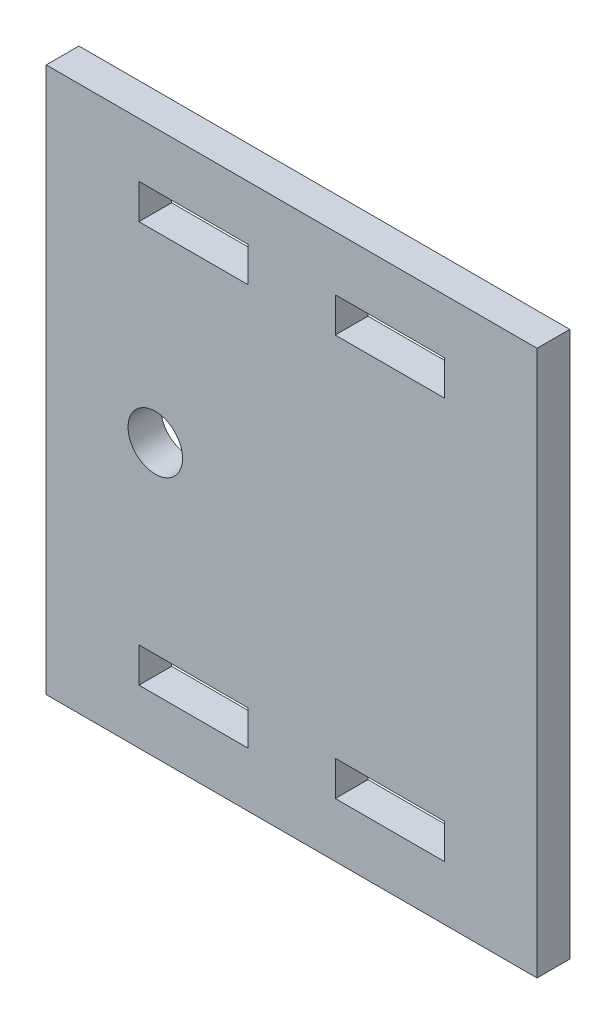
ISO-10303-21;
HEADER;
FILE_DESCRIPTION(('STEP AP214'),'2;1');
FILE_NAME('part.step','',(''),(''),'','','');
FILE_SCHEMA(('AUTOMOTIVE_DESIGN { 1 0 10303 214 1 1 1 1 }'));
ENDSEC;
DATA;
#1=APPLICATION_CONTEXT('core data for automotive mechanical design processes');
#2=APPLICATION_PROTOCOL_DEFINITION('international standard','automotive_design',2000,#1);
#3=PRODUCT_CONTEXT('',#1,'mechanical');
#4=PRODUCT('Part','Part','',(#3));
#5=PRODUCT_RELATED_PRODUCT_CATEGORY('part','',(#4));
#6=PRODUCT_DEFINITION_FORMATION('','',#4);
#7=PRODUCT_DEFINITION_CONTEXT('part definition',#1,'design');
#8=PRODUCT_DEFINITION('design','',#6,#7);
#9=PRODUCT_DEFINITION_SHAPE('','',#8);
#10=(LENGTH_UNIT() NAMED_UNIT(*) SI_UNIT(.MILLI.,.METRE.));
#11=(NAMED_UNIT(*) PLANE_ANGLE_UNIT() SI_UNIT($,.RADIAN.));
#12=(NAMED_UNIT(*) SI_UNIT($,.STERADIAN.) SOLID_ANGLE_UNIT());
#13=UNCERTAINTY_MEASURE_WITH_UNIT(LENGTH_MEASURE(1.E-05),#10,'distance_accuracy_value','');
#14=(GEOMETRIC_REPRESENTATION_CONTEXT(3) GLOBAL_UNCERTAINTY_ASSIGNED_CONTEXT((#13)) GLOBAL_UNIT_ASSIGNED_CONTEXT((#10,
#11,#12)) REPRESENTATION_CONTEXT('',''));
#15=CARTESIAN_POINT('',(0.,0.,0.));
#16=DIRECTION('',(0.,0.,1.));
#17=DIRECTION('',(1.,0.,0.));
#18=AXIS2_PLACEMENT_3D('',#15,#16,#17);
#19=CARTESIAN_POINT('',(0.,0.,3.));
#20=DIRECTION('',(0.,0.,1.));
#21=DIRECTION('',(1.,0.,0.));
#22=AXIS2_PLACEMENT_3D('',#19,#20,#21);
#23=PLANE('',#22);
#24=DIRECTION('',(0.,-1.,0.));
#25=VECTOR('',#24,1.);
#26=CARTESIAN_POINT('',(-10.,25.,3.));
#27=LINE('',#26,#25);
#28=CARTESIAN_POINT('',(-10.,25.,3.));
#29=VERTEX_POINT('',#28);
#30=CARTESIAN_POINT('',(-10.,-25.,3.));
#31=VERTEX_POINT('',#30);
#32=EDGE_CURVE('E305',#29,#31,#27,.T.);
#33=ORIENTED_EDGE('',*,*,#32,.T.);
#34=DIRECTION('',(1.,0.,0.));
#35=VECTOR('',#34,1.);
#36=CARTESIAN_POINT('',(-10.,-25.,3.));
#37=LINE('',#36,#35);
#38=CARTESIAN_POINT('',(35.,-25.,3.));
#39=VERTEX_POINT('',#38);
#40=EDGE_CURVE('E308',#31,#39,#37,.T.);
#41=ORIENTED_EDGE('',*,*,#40,.T.);
#42=DIRECTION('',(0.,1.,0.));
#43=VECTOR('',#42,1.);
#44=CARTESIAN_POINT('',(35.,25.,3.));
#45=LINE('',#44,#43);
#46=CARTESIAN_POINT('',(35.,25.,3.));
#47=VERTEX_POINT('',#46);
#48=EDGE_CURVE('E311',#39,#47,#45,.T.);
#49=ORIENTED_EDGE('',*,*,#48,.T.);
#50=DIRECTION('',(-1.,0.,0.));
#51=VECTOR('',#50,1.);
#52=CARTESIAN_POINT('',(-10.,25.,3.));
#53=LINE('',#52,#51);
#54=EDGE_CURVE('E313',#47,#29,#53,.T.);
#55=ORIENTED_EDGE('',*,*,#54,.T.);
#56=EDGE_LOOP('',(#33,#41,#49,#55));
#57=FACE_BOUND('',#56,.T.);
#58=CARTESIAN_POINT('',(0.,0.,3.));
#59=DIRECTION('',(0.,0.,1.));
#60=DIRECTION('',(1.,0.,0.));
#61=AXIS2_PLACEMENT_3D('',#58,#59,#60);
#62=CIRCLE('',#61,2.5);
#63=CARTESIAN_POINT('',(2.5,0.,3.));
#64=VERTEX_POINT('',#63);
#65=EDGE_CURVE('E299',#64,#64,#62,.T.);
#66=ORIENTED_EDGE('',*,*,#65,.F.);
#67=EDGE_LOOP('',(#66));
#68=FACE_BOUND('',#67,.T.);
#69=DIRECTION('',(1.,0.,0.));
#70=VECTOR('',#69,1.);
#71=CARTESIAN_POINT('',(-1.5,16.8,3.));
#72=LINE('',#71,#70);
#73=CARTESIAN_POINT('',(-1.5,16.8,3.));
#74=VERTEX_POINT('',#73);
#75=CARTESIAN_POINT('',(8.5,16.8,3.));
#76=VERTEX_POINT('',#75);
#77=EDGE_CURVE('E270',#74,#76,#72,.T.);
#78=ORIENTED_EDGE('',*,*,#77,.F.);
#79=DIRECTION('',(0.,-1.,0.));
#80=VECTOR('',#79,1.);
#81=CARTESIAN_POINT('',(-1.5,20.,3.));
#82=LINE('',#81,#80);
#83=CARTESIAN_POINT('',(-1.5,20.,3.));
#84=VERTEX_POINT('',#83);
#85=EDGE_CURVE('E268',#84,#74,#82,.T.);
#86=ORIENTED_EDGE('',*,*,#85,.F.);
#87=DIRECTION('',(-1.,0.,0.));
#88=VECTOR('',#87,1.);
#89=CARTESIAN_POINT('',(-1.5,20.,3.));
#90=LINE('',#89,#88);
#91=CARTESIAN_POINT('',(8.5,20.,3.));
#92=VERTEX_POINT('',#91);
#93=EDGE_CURVE('E276',#92,#84,#90,.T.);
#94=ORIENTED_EDGE('',*,*,#93,.F.);
#95=DIRECTION('',(0.,1.,0.));
#96=VECTOR('',#95,1.);
#97=CARTESIAN_POINT('',(8.5,20.,3.));
#98=LINE('',#97,#96);
#99=EDGE_CURVE('E273',#76,#92,#98,.T.);
#100=ORIENTED_EDGE('',*,*,#99,.F.);
#101=EDGE_LOOP('',(#78,#86,#94,#100));
#102=FACE_BOUND('',#101,.T.);
#103=DIRECTION('',(1.,0.,0.));
#104=VECTOR('',#103,1.);
#105=CARTESIAN_POINT('',(16.5,16.8,3.));
#106=LINE('',#105,#104);
#107=CARTESIAN_POINT('',(16.5,16.8,3.));
#108=VERTEX_POINT('',#107);
#109=CARTESIAN_POINT('',(26.5,16.8,3.));
#110=VERTEX_POINT('',#109);
#111=EDGE_CURVE('E239',#108,#110,#106,.T.);
#112=ORIENTED_EDGE('',*,*,#111,.F.);
#113=DIRECTION('',(0.,-1.,0.));
#114=VECTOR('',#113,1.);
#115=CARTESIAN_POINT('',(16.5,20.,3.));
#116=LINE('',#115,#114);
#117=CARTESIAN_POINT('',(16.5,20.,3.));
#118=VERTEX_POINT('',#117);
#119=EDGE_CURVE('E237',#118,#108,#116,.T.);
#120=ORIENTED_EDGE('',*,*,#119,.F.);
#121=DIRECTION('',(-1.,0.,0.));
#122=VECTOR('',#121,1.);
#123=CARTESIAN_POINT('',(16.5,20.,3.));
#124=LINE('',#123,#122);
#125=CARTESIAN_POINT('',(26.5,20.,3.));
#126=VERTEX_POINT('',#125);
#127=EDGE_CURVE('E245',#126,#118,#124,.T.);
#128=ORIENTED_EDGE('',*,*,#127,.F.);
#129=DIRECTION('',(0.,1.,0.));
#130=VECTOR('',#129,1.);
#131=CARTESIAN_POINT('',(26.5,20.,3.));
#132=LINE('',#131,#130);
#133=EDGE_CURVE('E242',#110,#126,#132,.T.);
#134=ORIENTED_EDGE('',*,*,#133,.F.);
#135=EDGE_LOOP('',(#112,#120,#128,#134));
#136=FACE_BOUND('',#135,.T.);
#137=DIRECTION('',(1.,0.,0.));
#138=VECTOR('',#137,1.);
#139=CARTESIAN_POINT('',(16.5,-20.,3.));
#140=LINE('',#139,#138);
#141=CARTESIAN_POINT('',(16.5,-20.,3.));
#142=VERTEX_POINT('',#141);
#143=CARTESIAN_POINT('',(26.5,-20.,3.));
#144=VERTEX_POINT('',#143);
#145=EDGE_CURVE('E208',#142,#144,#140,.T.);
#146=ORIENTED_EDGE('',*,*,#145,.F.);
#147=DIRECTION('',(0.,-1.,0.));
#148=VECTOR('',#147,1.);
#149=CARTESIAN_POINT('',(16.5,-20.,3.));
#150=LINE('',#149,#148);
#151=CARTESIAN_POINT('',(16.5,-16.8,3.));
#152=VERTEX_POINT('',#151);
#153=EDGE_CURVE('E206',#152,#142,#150,.T.);
#154=ORIENTED_EDGE('',*,*,#153,.F.);
#155=DIRECTION('',(-1.,0.,0.));
#156=VECTOR('',#155,1.);
#157=CARTESIAN_POINT('',(16.5,-16.8,3.));
#158=LINE('',#157,#156);
#159=CARTESIAN_POINT('',(26.5,-16.8,3.));
#160=VERTEX_POINT('',#159);
#161=EDGE_CURVE('E214',#160,#152,#158,.T.);
#162=ORIENTED_EDGE('',*,*,#161,.F.);
#163=DIRECTION('',(0.,1.,0.));
#164=VECTOR('',#163,1.);
#165=CARTESIAN_POINT('',(26.5,-20.,3.));
#166=LINE('',#165,#164);
#167=EDGE_CURVE('E211',#144,#160,#166,.T.);
#168=ORIENTED_EDGE('',*,*,#167,.F.);
#169=EDGE_LOOP('',(#146,#154,#162,#168));
#170=FACE_BOUND('',#169,.T.);
#171=DIRECTION('',(0.,1.,0.));
#172=VECTOR('',#171,1.);
#173=CARTESIAN_POINT('',(8.5,-20.,3.));
#174=LINE('',#173,#172);
#175=CARTESIAN_POINT('',(8.5,-20.,3.));
#176=VERTEX_POINT('',#175);
#177=CARTESIAN_POINT('',(8.5,-16.8,3.));
#178=VERTEX_POINT('',#177);
#179=EDGE_CURVE('E178',#176,#178,#174,.T.);
#180=ORIENTED_EDGE('',*,*,#179,.F.);
#181=DIRECTION('',(1.,0.,0.));
#182=VECTOR('',#181,1.);
#183=CARTESIAN_POINT('',(-1.5,-20.,3.));
#184=LINE('',#183,#182);
#185=CARTESIAN_POINT('',(-1.5,-20.,3.));
#186=VERTEX_POINT('',#185);
#187=EDGE_CURVE('E170',#186,#176,#184,.T.);
#188=ORIENTED_EDGE('',*,*,#187,.F.);
#189=DIRECTION('',(0.,-1.,0.));
#190=VECTOR('',#189,1.);
#191=CARTESIAN_POINT('',(-1.5,-20.,3.));
#192=LINE('',#191,#190);
#193=CARTESIAN_POINT('',(-1.5,-16.8,3.));
#194=VERTEX_POINT('',#193);
#195=EDGE_CURVE('E192',#194,#186,#192,.T.);
#196=ORIENTED_EDGE('',*,*,#195,.F.);
#197=DIRECTION('',(-1.,0.,0.));
#198=VECTOR('',#197,1.);
#199=CARTESIAN_POINT('',(-1.5,-16.8,3.));
#200=LINE('',#199,#198);
#201=EDGE_CURVE('E190',#178,#194,#200,.T.);
#202=ORIENTED_EDGE('',*,*,#201,.F.);
#203=EDGE_LOOP('',(#180,#188,#196,#202));
#204=FACE_BOUND('',#203,.T.);
#205=ADVANCED_FACE('F33',(#57,#68,#102,#136,#170,#204),#23,.T.);
#206=CARTESIAN_POINT('',(0.,0.,0.));
#207=DIRECTION('',(0.,0.,1.));
#208=DIRECTION('',(1.,0.,0.));
#209=AXIS2_PLACEMENT_3D('',#206,#207,#208);
#210=PLANE('',#209);
#211=DIRECTION('',(0.,-1.,0.));
#212=VECTOR('',#211,1.);
#213=CARTESIAN_POINT('',(16.5,-20.,0.));
#214=LINE('',#213,#212);
#215=CARTESIAN_POINT('',(16.5,-16.8,0.));
#216=VERTEX_POINT('',#215);
#217=CARTESIAN_POINT('',(16.5,-20.,0.));
#218=VERTEX_POINT('',#217);
#219=EDGE_CURVE('E186',#216,#218,#214,.T.);
#220=ORIENTED_EDGE('',*,*,#219,.T.);
#221=DIRECTION('',(1.,0.,0.));
#222=VECTOR('',#221,1.);
#223=CARTESIAN_POINT('',(16.5,-20.,0.));
#224=LINE('',#223,#222);
#225=CARTESIAN_POINT('',(26.5,-20.,0.));
#226=VERTEX_POINT('',#225);
#227=EDGE_CURVE('E219',#218,#226,#224,.T.);
#228=ORIENTED_EDGE('',*,*,#227,.T.);
#229=DIRECTION('',(0.,1.,0.));
#230=VECTOR('',#229,1.);
#231=CARTESIAN_POINT('',(26.5,-20.,0.));
#232=LINE('',#231,#230);
#233=CARTESIAN_POINT('',(26.5,-16.8,0.));
#234=VERTEX_POINT('',#233);
#235=EDGE_CURVE('E222',#226,#234,#232,.T.);
#236=ORIENTED_EDGE('',*,*,#235,.T.);
#237=DIRECTION('',(-1.,0.,0.));
#238=VECTOR('',#237,1.);
#239=CARTESIAN_POINT('',(16.5,-16.8,0.));
#240=LINE('',#239,#238);
#241=EDGE_CURVE('E209',#234,#216,#240,.T.);
#242=ORIENTED_EDGE('',*,*,#241,.T.);
#243=EDGE_LOOP('',(#220,#228,#236,#242));
#244=FACE_BOUND('',#243,.T.);
#245=DIRECTION('',(0.,-1.,0.));
#246=VECTOR('',#245,1.);
#247=CARTESIAN_POINT('',(-1.5,20.,0.));
#248=LINE('',#247,#246);
#249=CARTESIAN_POINT('',(-1.5,20.,0.));
#250=VERTEX_POINT('',#249);
#251=CARTESIAN_POINT('',(-1.5,16.8,0.));
#252=VERTEX_POINT('',#251);
#253=EDGE_CURVE('E267',#250,#252,#248,.T.);
#254=ORIENTED_EDGE('',*,*,#253,.T.);
#255=DIRECTION('',(1.,0.,0.));
#256=VECTOR('',#255,1.);
#257=CARTESIAN_POINT('',(-1.5,16.8,0.));
#258=LINE('',#257,#256);
#259=CARTESIAN_POINT('',(8.5,16.8,0.));
#260=VERTEX_POINT('',#259);
#261=EDGE_CURVE('E281',#252,#260,#258,.T.);
#262=ORIENTED_EDGE('',*,*,#261,.T.);
#263=DIRECTION('',(0.,1.,0.));
#264=VECTOR('',#263,1.);
#265=CARTESIAN_POINT('',(8.5,20.,0.));
#266=LINE('',#265,#264);
#267=CARTESIAN_POINT('',(8.5,20.,0.));
#268=VERTEX_POINT('',#267);
#269=EDGE_CURVE('E284',#260,#268,#266,.T.);
#270=ORIENTED_EDGE('',*,*,#269,.T.);
#271=DIRECTION('',(-1.,0.,0.));
#272=VECTOR('',#271,1.);
#273=CARTESIAN_POINT('',(-1.5,20.,0.));
#274=LINE('',#273,#272);
#275=EDGE_CURVE('E271',#268,#250,#274,.T.);
#276=ORIENTED_EDGE('',*,*,#275,.T.);
#277=EDGE_LOOP('',(#254,#262,#270,#276));
#278=FACE_BOUND('',#277,.T.);
#279=DIRECTION('',(0.,-1.,0.));
#280=VECTOR('',#279,1.);
#281=CARTESIAN_POINT('',(-10.,25.,0.));
#282=LINE('',#281,#280);
#283=CARTESIAN_POINT('',(-10.,25.,0.));
#284=VERTEX_POINT('',#283);
#285=CARTESIAN_POINT('',(-10.,-25.,0.));
#286=VERTEX_POINT('',#285);
#287=EDGE_CURVE('E302',#284,#286,#282,.T.);
#288=ORIENTED_EDGE('',*,*,#287,.F.);
#289=DIRECTION('',(-1.,0.,0.));
#290=VECTOR('',#289,1.);
#291=CARTESIAN_POINT('',(-10.,25.,0.));
#292=LINE('',#291,#290);
#293=CARTESIAN_POINT('',(35.,25.,0.));
#294=VERTEX_POINT('',#293);
#295=EDGE_CURVE('E309',#294,#284,#292,.T.);
#296=ORIENTED_EDGE('',*,*,#295,.F.);
#297=DIRECTION('',(0.,1.,0.));
#298=VECTOR('',#297,1.);
#299=CARTESIAN_POINT('',(35.,25.,0.));
#300=LINE('',#299,#298);
#301=CARTESIAN_POINT('',(35.,-25.,0.));
#302=VERTEX_POINT('',#301);
#303=EDGE_CURVE('E320',#302,#294,#300,.T.);
#304=ORIENTED_EDGE('',*,*,#303,.F.);
#305=DIRECTION('',(1.,0.,0.));
#306=VECTOR('',#305,1.);
#307=CARTESIAN_POINT('',(-10.,-25.,0.));
#308=LINE('',#307,#306);
#309=EDGE_CURVE('E318',#286,#302,#308,.T.);
#310=ORIENTED_EDGE('',*,*,#309,.F.);
#311=EDGE_LOOP('',(#288,#296,#304,#310));
#312=FACE_BOUND('',#311,.T.);
#313=CARTESIAN_POINT('',(0.,0.,0.));
#314=DIRECTION('',(0.,0.,1.));
#315=DIRECTION('',(1.,0.,0.));
#316=AXIS2_PLACEMENT_3D('',#313,#314,#315);
#317=CIRCLE('',#316,2.5);
#318=CARTESIAN_POINT('',(2.5,0.,0.));
#319=VERTEX_POINT('',#318);
#320=EDGE_CURVE('E298',#319,#319,#317,.T.);
#321=ORIENTED_EDGE('',*,*,#320,.T.);
#322=EDGE_LOOP('',(#321));
#323=FACE_BOUND('',#322,.T.);
#324=DIRECTION('',(0.,-1.,0.));
#325=VECTOR('',#324,1.);
#326=CARTESIAN_POINT('',(16.5,20.,0.));
#327=LINE('',#326,#325);
#328=CARTESIAN_POINT('',(16.5,20.,0.));
#329=VERTEX_POINT('',#328);
#330=CARTESIAN_POINT('',(16.5,16.8,0.));
#331=VERTEX_POINT('',#330);
#332=EDGE_CURVE('E236',#329,#331,#327,.T.);
#333=ORIENTED_EDGE('',*,*,#332,.T.);
#334=DIRECTION('',(1.,0.,0.));
#335=VECTOR('',#334,1.);
#336=CARTESIAN_POINT('',(16.5,16.8,0.));
#337=LINE('',#336,#335);
#338=CARTESIAN_POINT('',(26.5,16.8,0.));
#339=VERTEX_POINT('',#338);
#340=EDGE_CURVE('E250',#331,#339,#337,.T.);
#341=ORIENTED_EDGE('',*,*,#340,.T.);
#342=DIRECTION('',(0.,1.,0.));
#343=VECTOR('',#342,1.);
#344=CARTESIAN_POINT('',(26.5,20.,0.));
#345=LINE('',#344,#343);
#346=CARTESIAN_POINT('',(26.5,20.,0.));
#347=VERTEX_POINT('',#346);
#348=EDGE_CURVE('E253',#339,#347,#345,.T.);
#349=ORIENTED_EDGE('',*,*,#348,.T.);
#350=DIRECTION('',(-1.,0.,0.));
#351=VECTOR('',#350,1.);
#352=CARTESIAN_POINT('',(16.5,20.,0.));
#353=LINE('',#352,#351);
#354=EDGE_CURVE('E240',#347,#329,#353,.T.);
#355=ORIENTED_EDGE('',*,*,#354,.T.);
#356=EDGE_LOOP('',(#333,#341,#349,#355));
#357=FACE_BOUND('',#356,.T.);
#358=DIRECTION('',(1.,0.,0.));
#359=VECTOR('',#358,1.);
#360=CARTESIAN_POINT('',(-1.5,-20.,0.));
#361=LINE('',#360,#359);
#362=CARTESIAN_POINT('',(-1.5,-20.,0.));
#363=VERTEX_POINT('',#362);
#364=CARTESIAN_POINT('',(8.5,-20.,0.));
#365=VERTEX_POINT('',#364);
#366=EDGE_CURVE('E56',#363,#365,#361,.T.);
#367=ORIENTED_EDGE('',*,*,#366,.T.);
#368=DIRECTION('',(0.,1.,0.));
#369=VECTOR('',#368,1.);
#370=CARTESIAN_POINT('',(8.5,-20.,0.));
#371=LINE('',#370,#369);
#372=CARTESIAN_POINT('',(8.5,-16.8,0.));
#373=VERTEX_POINT('',#372);
#374=EDGE_CURVE('E185',#365,#373,#371,.T.);
#375=ORIENTED_EDGE('',*,*,#374,.T.);
#376=DIRECTION('',(-1.,0.,0.));
#377=VECTOR('',#376,1.);
#378=CARTESIAN_POINT('',(-1.5,-16.8,0.));
#379=LINE('',#378,#377);
#380=CARTESIAN_POINT('',(-1.5,-16.8,0.));
#381=VERTEX_POINT('',#380);
#382=EDGE_CURVE('E198',#373,#381,#379,.T.);
#383=ORIENTED_EDGE('',*,*,#382,.T.);
#384=DIRECTION('',(0.,-1.,0.));
#385=VECTOR('',#384,1.);
#386=CARTESIAN_POINT('',(-1.5,-20.,0.));
#387=LINE('',#386,#385);
#388=EDGE_CURVE('E179',#381,#363,#387,.T.);
#389=ORIENTED_EDGE('',*,*,#388,.T.);
#390=EDGE_LOOP('',(#367,#375,#383,#389));
#391=FACE_BOUND('',#390,.T.);
#392=ADVANCED_FACE('F338',(#244,#278,#312,#323,#357,#391),#210,.F.);
#393=CARTESIAN_POINT('',(-10.,25.,3.));
#394=DIRECTION('',(1.,0.,0.));
#395=DIRECTION('',(0.,1.,0.));
#396=AXIS2_PLACEMENT_3D('',#393,#394,#395);
#397=PLANE('',#396);
#398=ORIENTED_EDGE('',*,*,#287,.T.);
#399=DIRECTION('',(0.,0.,-1.));
#400=VECTOR('',#399,1.);
#401=CARTESIAN_POINT('',(-10.,-25.,3.));
#402=LINE('',#401,#400);
#403=EDGE_CURVE('E11',#31,#286,#402,.T.);
#404=ORIENTED_EDGE('',*,*,#403,.F.);
#405=ORIENTED_EDGE('',*,*,#32,.F.);
#406=DIRECTION('',(0.,0.,-1.));
#407=VECTOR('',#406,1.);
#408=CARTESIAN_POINT('',(-10.,25.,3.));
#409=LINE('',#408,#407);
#410=EDGE_CURVE('E315',#29,#284,#409,.T.);
#411=ORIENTED_EDGE('',*,*,#410,.T.);
#412=EDGE_LOOP('',(#398,#404,#405,#411));
#413=FACE_BOUND('',#412,.T.);
#414=ADVANCED_FACE('F35',(#413),#397,.F.);
#415=CARTESIAN_POINT('',(-10.,-25.,3.));
#416=DIRECTION('',(0.,1.,0.));
#417=DIRECTION('',(0.,0.,1.));
#418=AXIS2_PLACEMENT_3D('',#415,#416,#417);
#419=PLANE('',#418);
#420=ORIENTED_EDGE('',*,*,#309,.T.);
#421=DIRECTION('',(0.,0.,-1.));
#422=VECTOR('',#421,1.);
#423=CARTESIAN_POINT('',(35.,-25.,3.));
#424=LINE('',#423,#422);
#425=EDGE_CURVE('E41',#39,#302,#424,.T.);
#426=ORIENTED_EDGE('',*,*,#425,.F.);
#427=ORIENTED_EDGE('',*,*,#40,.F.);
#428=ORIENTED_EDGE('',*,*,#403,.T.);
#429=EDGE_LOOP('',(#420,#426,#427,#428));
#430=FACE_BOUND('',#429,.T.);
#431=ADVANCED_FACE('F349',(#430),#419,.F.);
#432=CARTESIAN_POINT('',(35.,25.,3.));
#433=DIRECTION('',(-1.,0.,0.));
#434=DIRECTION('',(0.,-1.,0.));
#435=AXIS2_PLACEMENT_3D('',#432,#433,#434);
#436=PLANE('',#435);
#437=ORIENTED_EDGE('',*,*,#303,.T.);
#438=DIRECTION('',(0.,0.,-1.));
#439=VECTOR('',#438,1.);
#440=CARTESIAN_POINT('',(35.,25.,3.));
#441=LINE('',#440,#439);
#442=EDGE_CURVE('E325',#47,#294,#441,.T.);
#443=ORIENTED_EDGE('',*,*,#442,.F.);
#444=ORIENTED_EDGE('',*,*,#48,.F.);
#445=ORIENTED_EDGE('',*,*,#425,.T.);
#446=EDGE_LOOP('',(#437,#443,#444,#445));
#447=FACE_BOUND('',#446,.T.);
#448=ADVANCED_FACE('F332',(#447),#436,.F.);
#449=CARTESIAN_POINT('',(-10.,25.,3.));
#450=DIRECTION('',(0.,-1.,0.));
#451=DIRECTION('',(1.,0.,0.));
#452=AXIS2_PLACEMENT_3D('',#449,#450,#451);
#453=PLANE('',#452);
#454=ORIENTED_EDGE('',*,*,#295,.T.);
#455=ORIENTED_EDGE('',*,*,#410,.F.);
#456=ORIENTED_EDGE('',*,*,#54,.F.);
#457=ORIENTED_EDGE('',*,*,#442,.T.);
#458=EDGE_LOOP('',(#454,#455,#456,#457));
#459=FACE_BOUND('',#458,.T.);
#460=ADVANCED_FACE('F342',(#459),#453,.F.);
#461=CARTESIAN_POINT('',(0.,0.,3.));
#462=DIRECTION('',(0.,0.,-1.));
#463=DIRECTION('',(-1.,0.,0.));
#464=AXIS2_PLACEMENT_3D('',#461,#462,#463);
#465=CYLINDRICAL_SURFACE('',#464,2.5);
#466=ORIENTED_EDGE('',*,*,#65,.T.);
#467=EDGE_LOOP('',(#466));
#468=FACE_BOUND('',#467,.T.);
#469=ORIENTED_EDGE('',*,*,#320,.F.);
#470=EDGE_LOOP('',(#469));
#471=FACE_BOUND('',#470,.T.);
#472=ADVANCED_FACE('F364',(#468,#471),#465,.F.);
#473=CARTESIAN_POINT('',(-1.5,20.,3.));
#474=DIRECTION('',(1.,0.,0.));
#475=DIRECTION('',(0.,0.,-1.));
#476=AXIS2_PLACEMENT_3D('',#473,#474,#475);
#477=PLANE('',#476);
#478=ORIENTED_EDGE('',*,*,#253,.F.);
#479=DIRECTION('',(0.,0.,-1.));
#480=VECTOR('',#479,1.);
#481=CARTESIAN_POINT('',(-1.5,20.,3.));
#482=LINE('',#481,#480);
#483=EDGE_CURVE('E278',#84,#250,#482,.T.);
#484=ORIENTED_EDGE('',*,*,#483,.F.);
#485=ORIENTED_EDGE('',*,*,#85,.T.);
#486=DIRECTION('',(0.,0.,-1.));
#487=VECTOR('',#486,1.);
#488=CARTESIAN_POINT('',(-1.5,16.8,3.));
#489=LINE('',#488,#487);
#490=EDGE_CURVE('E295',#74,#252,#489,.T.);
#491=ORIENTED_EDGE('',*,*,#490,.T.);
#492=EDGE_LOOP('',(#478,#484,#485,#491));
#493=FACE_BOUND('',#492,.T.);
#494=ADVANCED_FACE('F371',(#493),#477,.T.);
#495=CARTESIAN_POINT('',(-1.5,16.8,3.));
#496=DIRECTION('',(0.,1.,0.));
#497=DIRECTION('',(0.,0.,1.));
#498=AXIS2_PLACEMENT_3D('',#495,#496,#497);
#499=PLANE('',#498);
#500=ORIENTED_EDGE('',*,*,#261,.F.);
#501=ORIENTED_EDGE('',*,*,#490,.F.);
#502=ORIENTED_EDGE('',*,*,#77,.T.);
#503=DIRECTION('',(0.,0.,-1.));
#504=VECTOR('',#503,1.);
#505=CARTESIAN_POINT('',(8.5,16.8,3.));
#506=LINE('',#505,#504);
#507=EDGE_CURVE('E293',#76,#260,#506,.T.);
#508=ORIENTED_EDGE('',*,*,#507,.T.);
#509=EDGE_LOOP('',(#500,#501,#502,#508));
#510=FACE_BOUND('',#509,.T.);
#511=ADVANCED_FACE('F376',(#510),#499,.T.);
#512=CARTESIAN_POINT('',(8.5,20.,3.));
#513=DIRECTION('',(-1.,0.,0.));
#514=DIRECTION('',(0.,0.,1.));
#515=AXIS2_PLACEMENT_3D('',#512,#513,#514);
#516=PLANE('',#515);
#517=ORIENTED_EDGE('',*,*,#269,.F.);
#518=ORIENTED_EDGE('',*,*,#507,.F.);
#519=ORIENTED_EDGE('',*,*,#99,.T.);
#520=DIRECTION('',(0.,0.,-1.));
#521=VECTOR('',#520,1.);
#522=CARTESIAN_POINT('',(8.5,20.,3.));
#523=LINE('',#522,#521);
#524=EDGE_CURVE('E291',#92,#268,#523,.T.);
#525=ORIENTED_EDGE('',*,*,#524,.T.);
#526=EDGE_LOOP('',(#517,#518,#519,#525));
#527=FACE_BOUND('',#526,.T.);
#528=ADVANCED_FACE('F433',(#527),#516,.T.);
#529=CARTESIAN_POINT('',(-1.5,20.,3.));
#530=DIRECTION('',(0.,-1.,0.));
#531=DIRECTION('',(0.,0.,-1.));
#532=AXIS2_PLACEMENT_3D('',#529,#530,#531);
#533=PLANE('',#532);
#534=ORIENTED_EDGE('',*,*,#275,.F.);
#535=ORIENTED_EDGE('',*,*,#524,.F.);
#536=ORIENTED_EDGE('',*,*,#93,.T.);
#537=ORIENTED_EDGE('',*,*,#483,.T.);
#538=EDGE_LOOP('',(#534,#535,#536,#537));
#539=FACE_BOUND('',#538,.T.);
#540=ADVANCED_FACE('F429',(#539),#533,.T.);
#541=CARTESIAN_POINT('',(16.5,20.,3.));
#542=DIRECTION('',(1.,0.,0.));
#543=DIRECTION('',(0.,0.,-1.));
#544=AXIS2_PLACEMENT_3D('',#541,#542,#543);
#545=PLANE('',#544);
#546=ORIENTED_EDGE('',*,*,#332,.F.);
#547=DIRECTION('',(0.,0.,-1.));
#548=VECTOR('',#547,1.);
#549=CARTESIAN_POINT('',(16.5,20.,3.));
#550=LINE('',#549,#548);
#551=EDGE_CURVE('E247',#118,#329,#550,.T.);
#552=ORIENTED_EDGE('',*,*,#551,.F.);
#553=ORIENTED_EDGE('',*,*,#119,.T.);
#554=DIRECTION('',(0.,0.,-1.));
#555=VECTOR('',#554,1.);
#556=CARTESIAN_POINT('',(16.5,16.8,3.));
#557=LINE('',#556,#555);
#558=EDGE_CURVE('E264',#108,#331,#557,.T.);
#559=ORIENTED_EDGE('',*,*,#558,.T.);
#560=EDGE_LOOP('',(#546,#552,#553,#559));
#561=FACE_BOUND('',#560,.T.);
#562=ADVANCED_FACE('F425',(#561),#545,.T.);
#563=CARTESIAN_POINT('',(16.5,16.8,3.));
#564=DIRECTION('',(0.,1.,0.));
#565=DIRECTION('',(-1.,0.,0.));
#566=AXIS2_PLACEMENT_3D('',#563,#564,#565);
#567=PLANE('',#566);
#568=ORIENTED_EDGE('',*,*,#340,.F.);
#569=ORIENTED_EDGE('',*,*,#558,.F.);
#570=ORIENTED_EDGE('',*,*,#111,.T.);
#571=DIRECTION('',(0.,0.,-1.));
#572=VECTOR('',#571,1.);
#573=CARTESIAN_POINT('',(26.5,16.8,3.));
#574=LINE('',#573,#572);
#575=EDGE_CURVE('E262',#110,#339,#574,.T.);
#576=ORIENTED_EDGE('',*,*,#575,.T.);
#577=EDGE_LOOP('',(#568,#569,#570,#576));
#578=FACE_BOUND('',#577,.T.);
#579=ADVANCED_FACE('F421',(#578),#567,.T.);
#580=CARTESIAN_POINT('',(26.5,20.,3.));
#581=DIRECTION('',(-1.,0.,0.));
#582=DIRECTION('',(0.,0.,1.));
#583=AXIS2_PLACEMENT_3D('',#580,#581,#582);
#584=PLANE('',#583);
#585=ORIENTED_EDGE('',*,*,#348,.F.);
#586=ORIENTED_EDGE('',*,*,#575,.F.);
#587=ORIENTED_EDGE('',*,*,#133,.T.);
#588=DIRECTION('',(0.,0.,-1.));
#589=VECTOR('',#588,1.);
#590=CARTESIAN_POINT('',(26.5,20.,3.));
#591=LINE('',#590,#589);
#592=EDGE_CURVE('E260',#126,#347,#591,.T.);
#593=ORIENTED_EDGE('',*,*,#592,.T.);
#594=EDGE_LOOP('',(#585,#586,#587,#593));
#595=FACE_BOUND('',#594,.T.);
#596=ADVANCED_FACE('F417',(#595),#584,.T.);
#597=CARTESIAN_POINT('',(16.5,20.,3.));
#598=DIRECTION('',(0.,-1.,0.));
#599=DIRECTION('',(0.,0.,-1.));
#600=AXIS2_PLACEMENT_3D('',#597,#598,#599);
#601=PLANE('',#600);
#602=ORIENTED_EDGE('',*,*,#354,.F.);
#603=ORIENTED_EDGE('',*,*,#592,.F.);
#604=ORIENTED_EDGE('',*,*,#127,.T.);
#605=ORIENTED_EDGE('',*,*,#551,.T.);
#606=EDGE_LOOP('',(#602,#603,#604,#605));
#607=FACE_BOUND('',#606,.T.);
#608=ADVANCED_FACE('F413',(#607),#601,.T.);
#609=CARTESIAN_POINT('',(16.5,-20.,3.));
#610=DIRECTION('',(1.,0.,0.));
#611=DIRECTION('',(0.,0.,-1.));
#612=AXIS2_PLACEMENT_3D('',#609,#610,#611);
#613=PLANE('',#612);
#614=ORIENTED_EDGE('',*,*,#219,.F.);
#615=DIRECTION('',(0.,0.,-1.));
#616=VECTOR('',#615,1.);
#617=CARTESIAN_POINT('',(16.5,-16.8,3.));
#618=LINE('',#617,#616);
#619=EDGE_CURVE('E216',#152,#216,#618,.T.);
#620=ORIENTED_EDGE('',*,*,#619,.F.);
#621=ORIENTED_EDGE('',*,*,#153,.T.);
#622=DIRECTION('',(0.,0.,-1.));
#623=VECTOR('',#622,1.);
#624=CARTESIAN_POINT('',(16.5,-20.,3.));
#625=LINE('',#624,#623);
#626=EDGE_CURVE('E233',#142,#218,#625,.T.);
#627=ORIENTED_EDGE('',*,*,#626,.T.);
#628=EDGE_LOOP('',(#614,#620,#621,#627));
#629=FACE_BOUND('',#628,.T.);
#630=ADVANCED_FACE('F409',(#629),#613,.T.);
#631=CARTESIAN_POINT('',(16.5,-20.,3.));
#632=DIRECTION('',(0.,1.,0.));
#633=DIRECTION('',(0.,0.,1.));
#634=AXIS2_PLACEMENT_3D('',#631,#632,#633);
#635=PLANE('',#634);
#636=ORIENTED_EDGE('',*,*,#227,.F.);
#637=ORIENTED_EDGE('',*,*,#626,.F.);
#638=ORIENTED_EDGE('',*,*,#145,.T.);
#639=DIRECTION('',(0.,0.,-1.));
#640=VECTOR('',#639,1.);
#641=CARTESIAN_POINT('',(26.5,-20.,3.));
#642=LINE('',#641,#640);
#643=EDGE_CURVE('E231',#144,#226,#642,.T.);
#644=ORIENTED_EDGE('',*,*,#643,.T.);
#645=EDGE_LOOP('',(#636,#637,#638,#644));
#646=FACE_BOUND('',#645,.T.);
#647=ADVANCED_FACE('F405',(#646),#635,.T.);
#648=CARTESIAN_POINT('',(26.5,-20.,3.));
#649=DIRECTION('',(-1.,0.,0.));
#650=DIRECTION('',(0.,0.,1.));
#651=AXIS2_PLACEMENT_3D('',#648,#649,#650);
#652=PLANE('',#651);
#653=ORIENTED_EDGE('',*,*,#235,.F.);
#654=ORIENTED_EDGE('',*,*,#643,.F.);
#655=ORIENTED_EDGE('',*,*,#167,.T.);
#656=DIRECTION('',(0.,0.,-1.));
#657=VECTOR('',#656,1.);
#658=CARTESIAN_POINT('',(26.5,-16.8,3.));
#659=LINE('',#658,#657);
#660=EDGE_CURVE('E229',#160,#234,#659,.T.);
#661=ORIENTED_EDGE('',*,*,#660,.T.);
#662=EDGE_LOOP('',(#653,#654,#655,#661));
#663=FACE_BOUND('',#662,.T.);
#664=ADVANCED_FACE('F401',(#663),#652,.T.);
#665=CARTESIAN_POINT('',(16.5,-16.8,3.));
#666=DIRECTION('',(0.,-1.,0.));
#667=DIRECTION('',(1.,0.,0.));
#668=AXIS2_PLACEMENT_3D('',#665,#666,#667);
#669=PLANE('',#668);
#670=ORIENTED_EDGE('',*,*,#241,.F.);
#671=ORIENTED_EDGE('',*,*,#660,.F.);
#672=ORIENTED_EDGE('',*,*,#161,.T.);
#673=ORIENTED_EDGE('',*,*,#619,.T.);
#674=EDGE_LOOP('',(#670,#671,#672,#673));
#675=FACE_BOUND('',#674,.T.);
#676=ADVANCED_FACE('F398',(#675),#669,.T.);
#677=CARTESIAN_POINT('',(-1.5,-20.,3.));
#678=DIRECTION('',(0.,1.,0.));
#679=DIRECTION('',(0.,0.,1.));
#680=AXIS2_PLACEMENT_3D('',#677,#678,#679);
#681=PLANE('',#680);
#682=ORIENTED_EDGE('',*,*,#366,.F.);
#683=DIRECTION('',(0.,0.,-1.));
#684=VECTOR('',#683,1.);
#685=CARTESIAN_POINT('',(-1.5,-20.,3.));
#686=LINE('',#685,#684);
#687=EDGE_CURVE('E174',#186,#363,#686,.T.);
#688=ORIENTED_EDGE('',*,*,#687,.F.);
#689=ORIENTED_EDGE('',*,*,#187,.T.);
#690=DIRECTION('',(0.,0.,-1.));
#691=VECTOR('',#690,1.);
#692=CARTESIAN_POINT('',(8.5,-20.,3.));
#693=LINE('',#692,#691);
#694=EDGE_CURVE('E173',#176,#365,#693,.T.);
#695=ORIENTED_EDGE('',*,*,#694,.T.);
#696=EDGE_LOOP('',(#682,#688,#689,#695));
#697=FACE_BOUND('',#696,.T.);
#698=ADVANCED_FACE('F172',(#697),#681,.T.);
#699=CARTESIAN_POINT('',(8.5,-20.,3.));
#700=DIRECTION('',(-1.,0.,0.));
#701=DIRECTION('',(0.,0.,1.));
#702=AXIS2_PLACEMENT_3D('',#699,#700,#701);
#703=PLANE('',#702);
#704=ORIENTED_EDGE('',*,*,#374,.F.);
#705=ORIENTED_EDGE('',*,*,#694,.F.);
#706=ORIENTED_EDGE('',*,*,#179,.T.);
#707=DIRECTION('',(0.,0.,-1.));
#708=VECTOR('',#707,1.);
#709=CARTESIAN_POINT('',(8.5,-16.8,3.));
#710=LINE('',#709,#708);
#711=EDGE_CURVE('E187',#178,#373,#710,.T.);
#712=ORIENTED_EDGE('',*,*,#711,.T.);
#713=EDGE_LOOP('',(#704,#705,#706,#712));
#714=FACE_BOUND('',#713,.T.);
#715=ADVANCED_FACE('F182',(#714),#703,.T.);
#716=CARTESIAN_POINT('',(-1.5,-16.8,3.));
#717=DIRECTION('',(0.,-1.,0.));
#718=DIRECTION('',(0.,0.,-1.));
#719=AXIS2_PLACEMENT_3D('',#716,#717,#718);
#720=PLANE('',#719);
#721=ORIENTED_EDGE('',*,*,#382,.F.);
#722=ORIENTED_EDGE('',*,*,#711,.F.);
#723=ORIENTED_EDGE('',*,*,#201,.T.);
#724=DIRECTION('',(0.,0.,-1.));
#725=VECTOR('',#724,1.);
#726=CARTESIAN_POINT('',(-1.5,-16.8,3.));
#727=LINE('',#726,#725);
#728=EDGE_CURVE('E48',#194,#381,#727,.T.);
#729=ORIENTED_EDGE('',*,*,#728,.T.);
#730=EDGE_LOOP('',(#721,#722,#723,#729));
#731=FACE_BOUND('',#730,.T.);
#732=ADVANCED_FACE('F386',(#731),#720,.T.);
#733=CARTESIAN_POINT('',(-1.5,-20.,3.));
#734=DIRECTION('',(1.,0.,0.));
#735=DIRECTION('',(0.,0.,-1.));
#736=AXIS2_PLACEMENT_3D('',#733,#734,#735);
#737=PLANE('',#736);
#738=ORIENTED_EDGE('',*,*,#388,.F.);
#739=ORIENTED_EDGE('',*,*,#728,.F.);
#740=ORIENTED_EDGE('',*,*,#195,.T.);
#741=ORIENTED_EDGE('',*,*,#687,.T.);
#742=EDGE_LOOP('',(#738,#739,#740,#741));
#743=FACE_BOUND('',#742,.T.);
#744=ADVANCED_FACE('F384',(#743),#737,.T.);
#745=CLOSED_SHELL('',(#205,#392,#414,#431,#448,#460,#472,#494,#511,#528,#540,#562,#579,#596,
#608,#630,#647,#664,#676,#698,#715,#732,#744));
#746=MANIFOLD_SOLID_BREP('B2',#745);
#747=ADVANCED_BREP_SHAPE_REPRESENTATION('',(#18,#746),#14);
#748=SHAPE_DEFINITION_REPRESENTATION(#9,#747);
ENDSEC;
END-ISO-10303-21;
